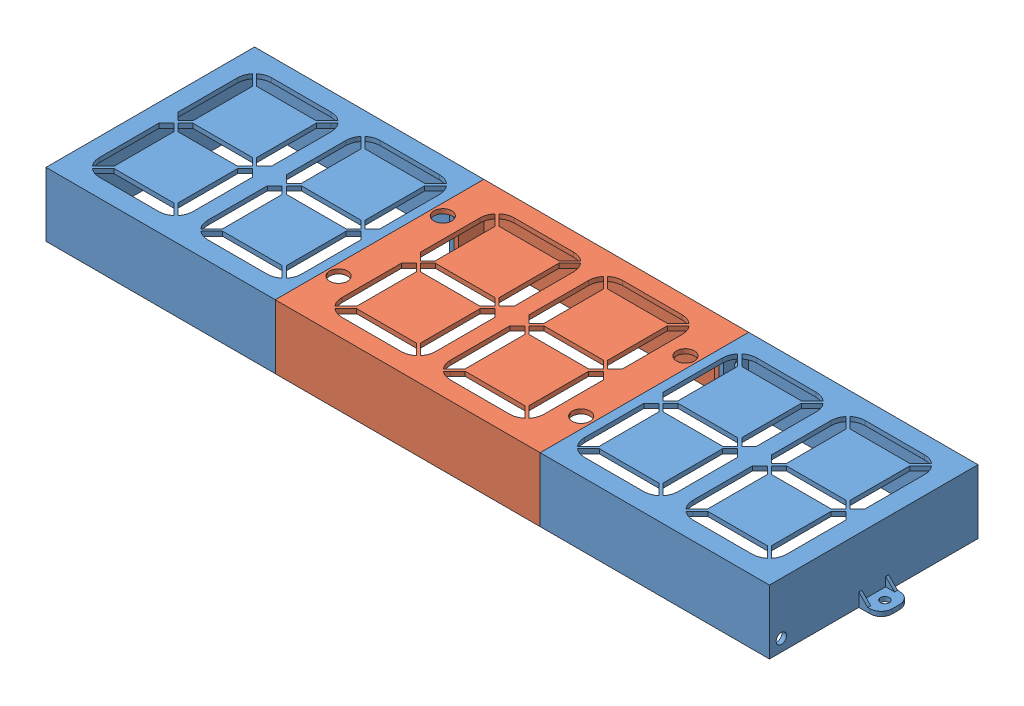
SolidWorks assembly Ensamblaje1.SLDASM, configuration Predeterminado (file format 14000). Lengths in mm.
Overall size (515.66 43 140.02).
3 component instances, 2 part files, 6 mates.
Components (placement in the parent):
- reloj digital-1: reloj digital.SLDPRT [Predeterminado] at (-62.7929 33.0551 0) size (168.91 43 140)
- reloj digital mid-2: reloj digital mid.SLDPRT [Predeterminado] at (100.0374 36.0551 0.0069) x (-1 0 0) z (0 0 1) size (177.83 43 140.02)
- reloj digital-2: reloj digital.SLDPRT [Predeterminado] at (262.8678 33.0551 0.0208) x (-1 0 0) z (0 0 -1) size (168.91 43 140)
Mates (geometry in assembly coordinates):
- Coincidente7: coincident aligned: plane of reloj digital-1 through (-62.7929 36.0551 0) normal (0 1 0); plane of reloj digital mid-2 through (100.0374 36.0551 0.0069) normal (0 1 0)
- Coincidente8: coincident aligned: plane of reloj digital-1 through (-142.7929 36.0551 -70) normal (0 0 -1); plane of reloj digital mid-2 through (188.9544 33.0551 -70) normal (0 0 -1)
- Coincidente9: coincident anti-aligned: plane of reloj digital-1 through (11.1205 36.0551 -70) normal (1 0 0); plane of reloj digital mid-2 through (11.1205 33.0551 -70) normal (-1 0 0)
- Coincidente10: coincident anti-aligned: plane of reloj digital mid-2 through (188.9544 33.0551 0.0104) normal (1 0 0); plane of reloj digital-2 through (188.9544 36.0551 70.0208) normal (-1 0 0)
- Coincidente11: coincident aligned: plane of reloj digital mid-2 through (11.1205 33.0551 70.0208) normal (0 0 1); plane of reloj digital-2 through (342.8678 36.0551 70.0208) normal (0 0 1)
- Coincidente12: coincident aligned: plane of reloj digital mid-2 through (100.0374 36.0551 0.0069) normal (0 1 0); plane of reloj digital-2 through (262.8678 36.0551 0.0208) normal (0 1 0)
